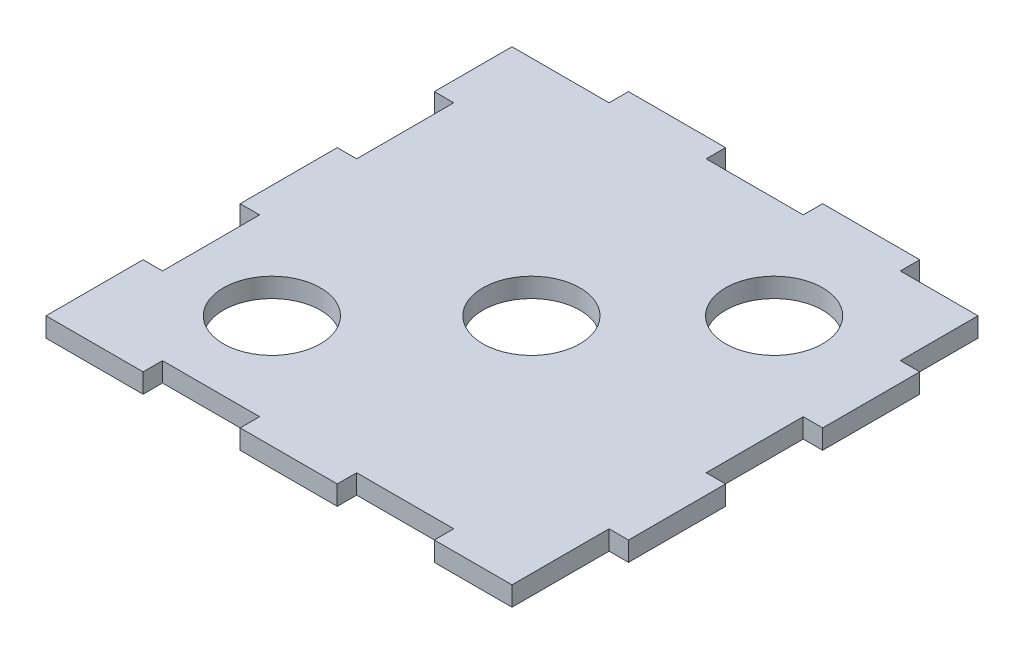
ISO-10303-21;
HEADER;
FILE_DESCRIPTION(('STEP AP214'),'2;1');
FILE_NAME('part.step','',(''),(''),'','','');
FILE_SCHEMA(('AUTOMOTIVE_DESIGN { 1 0 10303 214 1 1 1 1 }'));
ENDSEC;
DATA;
#1=APPLICATION_CONTEXT('core data for automotive mechanical design processes');
#2=APPLICATION_PROTOCOL_DEFINITION('international standard','automotive_design',2000,#1);
#3=PRODUCT_CONTEXT('',#1,'mechanical');
#4=PRODUCT('Part','Part','',(#3));
#5=PRODUCT_RELATED_PRODUCT_CATEGORY('part','',(#4));
#6=PRODUCT_DEFINITION_FORMATION('','',#4);
#7=PRODUCT_DEFINITION_CONTEXT('part definition',#1,'design');
#8=PRODUCT_DEFINITION('design','',#6,#7);
#9=PRODUCT_DEFINITION_SHAPE('','',#8);
#10=(LENGTH_UNIT() NAMED_UNIT(*) SI_UNIT(.MILLI.,.METRE.));
#11=(NAMED_UNIT(*) PLANE_ANGLE_UNIT() SI_UNIT($,.RADIAN.));
#12=(NAMED_UNIT(*) SI_UNIT($,.STERADIAN.) SOLID_ANGLE_UNIT());
#13=UNCERTAINTY_MEASURE_WITH_UNIT(LENGTH_MEASURE(1.E-05),#10,'distance_accuracy_value','');
#14=(GEOMETRIC_REPRESENTATION_CONTEXT(3) GLOBAL_UNCERTAINTY_ASSIGNED_CONTEXT((#13)) GLOBAL_UNIT_ASSIGNED_CONTEXT((#10,
#11,#12)) REPRESENTATION_CONTEXT('',''));
#15=CARTESIAN_POINT('',(0.,0.,0.));
#16=DIRECTION('',(0.,0.,1.));
#17=DIRECTION('',(1.,0.,0.));
#18=AXIS2_PLACEMENT_3D('',#15,#16,#17);
#19=CARTESIAN_POINT('',(0.,4.,0.));
#20=DIRECTION('',(0.,1.,0.));
#21=DIRECTION('',(0.,0.,1.));
#22=AXIS2_PLACEMENT_3D('',#19,#20,#21);
#23=PLANE('',#22);
#24=CARTESIAN_POINT('',(25.,4.,-25.));
#25=DIRECTION('',(0.,1.,0.));
#26=DIRECTION('',(0.,0.,1.));
#27=AXIS2_PLACEMENT_3D('',#24,#25,#26);
#28=CIRCLE('',#27,10.);
#29=CARTESIAN_POINT('',(25.,4.,-15.));
#30=VERTEX_POINT('',#29);
#31=EDGE_CURVE('E598',#30,#30,#28,.T.);
#32=ORIENTED_EDGE('',*,*,#31,.F.);
#33=EDGE_LOOP('',(#32));
#34=FACE_BOUND('',#33,.T.);
#35=DIRECTION('',(0.,0.,-1.));
#36=VECTOR('',#35,1.);
#37=CARTESIAN_POINT('',(46.,4.,30.));
#38=LINE('',#37,#36);
#39=CARTESIAN_POINT('',(46.,4.,50.));
#40=VERTEX_POINT('',#39);
#41=CARTESIAN_POINT('',(46.,4.,30.));
#42=VERTEX_POINT('',#41);
#43=EDGE_CURVE('E369',#40,#42,#38,.T.);
#44=ORIENTED_EDGE('',*,*,#43,.T.);
#45=DIRECTION('',(1.,0.,0.));
#46=VECTOR('',#45,1.);
#47=CARTESIAN_POINT('',(50.,4.,30.));
#48=LINE('',#47,#46);
#49=CARTESIAN_POINT('',(50.,4.,30.));
#50=VERTEX_POINT('',#49);
#51=EDGE_CURVE('E177',#42,#50,#48,.T.);
#52=ORIENTED_EDGE('',*,*,#51,.T.);
#53=DIRECTION('',(0.,0.,-1.));
#54=VECTOR('',#53,1.);
#55=CARTESIAN_POINT('',(50.,4.,9.99999999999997));
#56=LINE('',#55,#54);
#57=CARTESIAN_POINT('',(50.,4.,9.99999999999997));
#58=VERTEX_POINT('',#57);
#59=EDGE_CURVE('E468',#50,#58,#56,.T.);
#60=ORIENTED_EDGE('',*,*,#59,.T.);
#61=DIRECTION('',(-1.,0.,0.));
#62=VECTOR('',#61,1.);
#63=CARTESIAN_POINT('',(46.,4.,9.99999999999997));
#64=LINE('',#63,#62);
#65=CARTESIAN_POINT('',(46.,4.,9.99999999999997));
#66=VERTEX_POINT('',#65);
#67=EDGE_CURVE('E487',#58,#66,#64,.T.);
#68=ORIENTED_EDGE('',*,*,#67,.T.);
#69=DIRECTION('',(0.,0.,-1.));
#70=VECTOR('',#69,1.);
#71=CARTESIAN_POINT('',(46.,4.,-10.));
#72=LINE('',#71,#70);
#73=CARTESIAN_POINT('',(46.,4.,-10.));
#74=VERTEX_POINT('',#73);
#75=EDGE_CURVE('E484',#66,#74,#72,.T.);
#76=ORIENTED_EDGE('',*,*,#75,.T.);
#77=DIRECTION('',(1.,0.,0.));
#78=VECTOR('',#77,1.);
#79=CARTESIAN_POINT('',(50.,4.,-10.));
#80=LINE('',#79,#78);
#81=CARTESIAN_POINT('',(50.,4.,-10.));
#82=VERTEX_POINT('',#81);
#83=EDGE_CURVE('E486',#74,#82,#80,.T.);
#84=ORIENTED_EDGE('',*,*,#83,.T.);
#85=DIRECTION('',(0.,0.,-1.));
#86=VECTOR('',#85,1.);
#87=CARTESIAN_POINT('',(50.,4.,-30.));
#88=LINE('',#87,#86);
#89=CARTESIAN_POINT('',(50.,4.,-30.));
#90=VERTEX_POINT('',#89);
#91=EDGE_CURVE('E489',#82,#90,#88,.T.);
#92=ORIENTED_EDGE('',*,*,#91,.T.);
#93=DIRECTION('',(-1.,0.,0.));
#94=VECTOR('',#93,1.);
#95=CARTESIAN_POINT('',(46.,4.,-30.));
#96=LINE('',#95,#94);
#97=CARTESIAN_POINT('',(46.,4.,-30.));
#98=VERTEX_POINT('',#97);
#99=EDGE_CURVE('E495',#90,#98,#96,.T.);
#100=ORIENTED_EDGE('',*,*,#99,.T.);
#101=DIRECTION('',(0.,0.,-1.));
#102=VECTOR('',#101,1.);
#103=CARTESIAN_POINT('',(46.,4.,-46.));
#104=LINE('',#103,#102);
#105=CARTESIAN_POINT('',(46.,4.,-46.));
#106=VERTEX_POINT('',#105);
#107=EDGE_CURVE('E497',#98,#106,#104,.T.);
#108=ORIENTED_EDGE('',*,*,#107,.T.);
#109=DIRECTION('',(-1.,0.,0.));
#110=VECTOR('',#109,1.);
#111=CARTESIAN_POINT('',(30.,4.,-46.));
#112=LINE('',#111,#110);
#113=CARTESIAN_POINT('',(30.,4.,-46.));
#114=VERTEX_POINT('',#113);
#115=EDGE_CURVE('E499',#106,#114,#112,.T.);
#116=ORIENTED_EDGE('',*,*,#115,.T.);
#117=DIRECTION('',(0.,0.,-1.));
#118=VECTOR('',#117,1.);
#119=CARTESIAN_POINT('',(30.,4.,-50.));
#120=LINE('',#119,#118);
#121=CARTESIAN_POINT('',(30.,4.,-50.));
#122=VERTEX_POINT('',#121);
#123=EDGE_CURVE('E501',#114,#122,#120,.T.);
#124=ORIENTED_EDGE('',*,*,#123,.T.);
#125=DIRECTION('',(-1.,0.,0.));
#126=VECTOR('',#125,1.);
#127=CARTESIAN_POINT('',(9.99999999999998,4.,-50.));
#128=LINE('',#127,#126);
#129=CARTESIAN_POINT('',(9.99999999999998,4.,-50.));
#130=VERTEX_POINT('',#129);
#131=EDGE_CURVE('E503',#122,#130,#128,.T.);
#132=ORIENTED_EDGE('',*,*,#131,.T.);
#133=DIRECTION('',(0.,0.,1.));
#134=VECTOR('',#133,1.);
#135=CARTESIAN_POINT('',(9.99999999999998,4.,-46.));
#136=LINE('',#135,#134);
#137=CARTESIAN_POINT('',(9.99999999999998,4.,-46.));
#138=VERTEX_POINT('',#137);
#139=EDGE_CURVE('E505',#130,#138,#136,.T.);
#140=ORIENTED_EDGE('',*,*,#139,.T.);
#141=DIRECTION('',(-1.,0.,0.));
#142=VECTOR('',#141,1.);
#143=CARTESIAN_POINT('',(-10.,4.,-46.));
#144=LINE('',#143,#142);
#145=CARTESIAN_POINT('',(-10.,4.,-46.));
#146=VERTEX_POINT('',#145);
#147=EDGE_CURVE('E507',#138,#146,#144,.T.);
#148=ORIENTED_EDGE('',*,*,#147,.T.);
#149=DIRECTION('',(0.,0.,-1.));
#150=VECTOR('',#149,1.);
#151=CARTESIAN_POINT('',(-10.,4.,-50.));
#152=LINE('',#151,#150);
#153=CARTESIAN_POINT('',(-10.,4.,-50.));
#154=VERTEX_POINT('',#153);
#155=EDGE_CURVE('E509',#146,#154,#152,.T.);
#156=ORIENTED_EDGE('',*,*,#155,.T.);
#157=DIRECTION('',(-1.,0.,0.));
#158=VECTOR('',#157,1.);
#159=CARTESIAN_POINT('',(-30.,4.,-50.));
#160=LINE('',#159,#158);
#161=CARTESIAN_POINT('',(-30.,4.,-50.));
#162=VERTEX_POINT('',#161);
#163=EDGE_CURVE('E511',#154,#162,#160,.T.);
#164=ORIENTED_EDGE('',*,*,#163,.T.);
#165=DIRECTION('',(0.,0.,1.));
#166=VECTOR('',#165,1.);
#167=CARTESIAN_POINT('',(-30.,4.,-46.));
#168=LINE('',#167,#166);
#169=CARTESIAN_POINT('',(-30.,4.,-46.));
#170=VERTEX_POINT('',#169);
#171=EDGE_CURVE('E513',#162,#170,#168,.T.);
#172=ORIENTED_EDGE('',*,*,#171,.T.);
#173=DIRECTION('',(-1.,0.,0.));
#174=VECTOR('',#173,1.);
#175=CARTESIAN_POINT('',(-50.,4.,-46.));
#176=LINE('',#175,#174);
#177=CARTESIAN_POINT('',(-50.,4.,-46.));
#178=VERTEX_POINT('',#177);
#179=EDGE_CURVE('E515',#170,#178,#176,.T.);
#180=ORIENTED_EDGE('',*,*,#179,.T.);
#181=DIRECTION('',(0.,0.,1.));
#182=VECTOR('',#181,1.);
#183=CARTESIAN_POINT('',(-50.,4.,-46.));
#184=LINE('',#183,#182);
#185=CARTESIAN_POINT('',(-50.,4.,-30.));
#186=VERTEX_POINT('',#185);
#187=EDGE_CURVE('E517',#178,#186,#184,.T.);
#188=ORIENTED_EDGE('',*,*,#187,.T.);
#189=DIRECTION('',(1.,0.,0.));
#190=VECTOR('',#189,1.);
#191=CARTESIAN_POINT('',(-50.,4.,-30.));
#192=LINE('',#191,#190);
#193=CARTESIAN_POINT('',(-46.,4.,-30.));
#194=VERTEX_POINT('',#193);
#195=EDGE_CURVE('E519',#186,#194,#192,.T.);
#196=ORIENTED_EDGE('',*,*,#195,.T.);
#197=DIRECTION('',(0.,0.,1.));
#198=VECTOR('',#197,1.);
#199=CARTESIAN_POINT('',(-46.,4.,-30.));
#200=LINE('',#199,#198);
#201=CARTESIAN_POINT('',(-46.,4.,-10.));
#202=VERTEX_POINT('',#201);
#203=EDGE_CURVE('E521',#194,#202,#200,.T.);
#204=ORIENTED_EDGE('',*,*,#203,.T.);
#205=DIRECTION('',(-1.,0.,0.));
#206=VECTOR('',#205,1.);
#207=CARTESIAN_POINT('',(-46.,4.,-10.));
#208=LINE('',#207,#206);
#209=CARTESIAN_POINT('',(-50.,4.,-10.));
#210=VERTEX_POINT('',#209);
#211=EDGE_CURVE('E523',#202,#210,#208,.T.);
#212=ORIENTED_EDGE('',*,*,#211,.T.);
#213=DIRECTION('',(0.,0.,1.));
#214=VECTOR('',#213,1.);
#215=CARTESIAN_POINT('',(-50.,4.,-10.));
#216=LINE('',#215,#214);
#217=CARTESIAN_POINT('',(-50.,4.,9.99999999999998));
#218=VERTEX_POINT('',#217);
#219=EDGE_CURVE('E525',#210,#218,#216,.T.);
#220=ORIENTED_EDGE('',*,*,#219,.T.);
#221=DIRECTION('',(1.,0.,0.));
#222=VECTOR('',#221,1.);
#223=CARTESIAN_POINT('',(-50.,4.,9.99999999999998));
#224=LINE('',#223,#222);
#225=CARTESIAN_POINT('',(-46.,4.,9.99999999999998));
#226=VERTEX_POINT('',#225);
#227=EDGE_CURVE('E527',#218,#226,#224,.T.);
#228=ORIENTED_EDGE('',*,*,#227,.T.);
#229=DIRECTION('',(0.,0.,1.));
#230=VECTOR('',#229,1.);
#231=CARTESIAN_POINT('',(-46.,4.,9.99999999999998));
#232=LINE('',#231,#230);
#233=CARTESIAN_POINT('',(-46.,4.,30.));
#234=VERTEX_POINT('',#233);
#235=EDGE_CURVE('E529',#226,#234,#232,.T.);
#236=ORIENTED_EDGE('',*,*,#235,.T.);
#237=DIRECTION('',(-1.,0.,0.));
#238=VECTOR('',#237,1.);
#239=CARTESIAN_POINT('',(-46.,4.,30.));
#240=LINE('',#239,#238);
#241=CARTESIAN_POINT('',(-50.,4.,30.));
#242=VERTEX_POINT('',#241);
#243=EDGE_CURVE('E531',#234,#242,#240,.T.);
#244=ORIENTED_EDGE('',*,*,#243,.T.);
#245=DIRECTION('',(0.,0.,1.));
#246=VECTOR('',#245,1.);
#247=CARTESIAN_POINT('',(-50.,4.,30.));
#248=LINE('',#247,#246);
#249=CARTESIAN_POINT('',(-50.,4.,50.));
#250=VERTEX_POINT('',#249);
#251=EDGE_CURVE('E533',#242,#250,#248,.T.);
#252=ORIENTED_EDGE('',*,*,#251,.T.);
#253=DIRECTION('',(1.,0.,0.));
#254=VECTOR('',#253,1.);
#255=CARTESIAN_POINT('',(-50.,4.,50.));
#256=LINE('',#255,#254);
#257=CARTESIAN_POINT('',(-30.,4.,50.));
#258=VERTEX_POINT('',#257);
#259=EDGE_CURVE('E535',#250,#258,#256,.T.);
#260=ORIENTED_EDGE('',*,*,#259,.T.);
#261=DIRECTION('',(0.,0.,-1.));
#262=VECTOR('',#261,1.);
#263=CARTESIAN_POINT('',(-30.,4.,46.));
#264=LINE('',#263,#262);
#265=CARTESIAN_POINT('',(-30.,4.,46.));
#266=VERTEX_POINT('',#265);
#267=EDGE_CURVE('E537',#258,#266,#264,.T.);
#268=ORIENTED_EDGE('',*,*,#267,.T.);
#269=DIRECTION('',(1.,0.,0.));
#270=VECTOR('',#269,1.);
#271=CARTESIAN_POINT('',(-10.,4.,46.));
#272=LINE('',#271,#270);
#273=CARTESIAN_POINT('',(-10.,4.,46.));
#274=VERTEX_POINT('',#273);
#275=EDGE_CURVE('E539',#266,#274,#272,.T.);
#276=ORIENTED_EDGE('',*,*,#275,.T.);
#277=DIRECTION('',(0.,0.,1.));
#278=VECTOR('',#277,1.);
#279=CARTESIAN_POINT('',(-10.,4.,50.));
#280=LINE('',#279,#278);
#281=CARTESIAN_POINT('',(-10.,4.,50.));
#282=VERTEX_POINT('',#281);
#283=EDGE_CURVE('E541',#274,#282,#280,.T.);
#284=ORIENTED_EDGE('',*,*,#283,.T.);
#285=DIRECTION('',(1.,0.,0.));
#286=VECTOR('',#285,1.);
#287=CARTESIAN_POINT('',(-10.,4.,50.));
#288=LINE('',#287,#286);
#289=CARTESIAN_POINT('',(9.99999999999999,4.,50.));
#290=VERTEX_POINT('',#289);
#291=EDGE_CURVE('E543',#282,#290,#288,.T.);
#292=ORIENTED_EDGE('',*,*,#291,.T.);
#293=DIRECTION('',(0.,0.,-1.));
#294=VECTOR('',#293,1.);
#295=CARTESIAN_POINT('',(9.99999999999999,4.,50.));
#296=LINE('',#295,#294);
#297=CARTESIAN_POINT('',(9.99999999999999,4.,46.));
#298=VERTEX_POINT('',#297);
#299=EDGE_CURVE('E280',#290,#298,#296,.T.);
#300=ORIENTED_EDGE('',*,*,#299,.T.);
#301=DIRECTION('',(1.,0.,0.));
#302=VECTOR('',#301,1.);
#303=CARTESIAN_POINT('',(9.99999999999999,4.,46.));
#304=LINE('',#303,#302);
#305=CARTESIAN_POINT('',(30.,4.,46.));
#306=VERTEX_POINT('',#305);
#307=EDGE_CURVE('E274',#298,#306,#304,.T.);
#308=ORIENTED_EDGE('',*,*,#307,.T.);
#309=DIRECTION('',(0.,0.,1.));
#310=VECTOR('',#309,1.);
#311=CARTESIAN_POINT('',(30.,4.,46.));
#312=LINE('',#311,#310);
#313=CARTESIAN_POINT('',(30.,4.,50.));
#314=VERTEX_POINT('',#313);
#315=EDGE_CURVE('E278',#306,#314,#312,.T.);
#316=ORIENTED_EDGE('',*,*,#315,.T.);
#317=DIRECTION('',(1.,0.,0.));
#318=VECTOR('',#317,1.);
#319=CARTESIAN_POINT('',(30.,4.,50.));
#320=LINE('',#319,#318);
#321=EDGE_CURVE('E50',#314,#40,#320,.T.);
#322=ORIENTED_EDGE('',*,*,#321,.T.);
#323=EDGE_LOOP('',(#44,#52,#60,#68,#76,#84,#92,#100,#108,#116,#124,#132,#140,#148,#156,#164,
#172,#180,#188,#196,#204,#212,#220,#228,#236,#244,#252,#260,#268,#276,#284,#292,#300,#308,#316,#322));
#324=FACE_BOUND('',#323,.T.);
#325=CARTESIAN_POINT('',(0.,4.,0.));
#326=DIRECTION('',(0.,1.,0.));
#327=DIRECTION('',(0.,0.,1.));
#328=AXIS2_PLACEMENT_3D('',#325,#326,#327);
#329=CIRCLE('',#328,10.);
#330=CARTESIAN_POINT('',(0.,4.,10.));
#331=VERTEX_POINT('',#330);
#332=EDGE_CURVE('E302',#331,#331,#329,.T.);
#333=ORIENTED_EDGE('',*,*,#332,.F.);
#334=EDGE_LOOP('',(#333));
#335=FACE_BOUND('',#334,.T.);
#336=CARTESIAN_POINT('',(-26.7320869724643,4.,26.7320869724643));
#337=DIRECTION('',(0.,1.,0.));
#338=DIRECTION('',(0.,0.,1.));
#339=AXIS2_PLACEMENT_3D('',#336,#337,#338);
#340=CIRCLE('',#339,10.);
#341=CARTESIAN_POINT('',(-26.7320869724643,4.,36.7320869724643));
#342=VERTEX_POINT('',#341);
#343=EDGE_CURVE('E589',#342,#342,#340,.T.);
#344=ORIENTED_EDGE('',*,*,#343,.F.);
#345=EDGE_LOOP('',(#344));
#346=FACE_BOUND('',#345,.T.);
#347=ADVANCED_FACE('F33',(#34,#324,#335,#346),#23,.T.);
#348=CARTESIAN_POINT('',(0.,0.,0.));
#349=DIRECTION('',(0.,1.,0.));
#350=DIRECTION('',(0.,0.,1.));
#351=AXIS2_PLACEMENT_3D('',#348,#349,#350);
#352=PLANE('',#351);
#353=DIRECTION('',(0.,0.,-1.));
#354=VECTOR('',#353,1.);
#355=CARTESIAN_POINT('',(46.,0.,30.));
#356=LINE('',#355,#354);
#357=CARTESIAN_POINT('',(46.,0.,50.));
#358=VERTEX_POINT('',#357);
#359=CARTESIAN_POINT('',(46.,0.,30.));
#360=VERTEX_POINT('',#359);
#361=EDGE_CURVE('E298',#358,#360,#356,.T.);
#362=ORIENTED_EDGE('',*,*,#361,.F.);
#363=DIRECTION('',(1.,0.,0.));
#364=VECTOR('',#363,1.);
#365=CARTESIAN_POINT('',(30.,0.,50.));
#366=LINE('',#365,#364);
#367=CARTESIAN_POINT('',(30.,0.,50.));
#368=VERTEX_POINT('',#367);
#369=EDGE_CURVE('E169',#368,#358,#366,.T.);
#370=ORIENTED_EDGE('',*,*,#369,.F.);
#371=DIRECTION('',(0.,0.,1.));
#372=VECTOR('',#371,1.);
#373=CARTESIAN_POINT('',(30.,0.,46.));
#374=LINE('',#373,#372);
#375=CARTESIAN_POINT('',(30.,0.,46.));
#376=VERTEX_POINT('',#375);
#377=EDGE_CURVE('E163',#376,#368,#374,.T.);
#378=ORIENTED_EDGE('',*,*,#377,.F.);
#379=DIRECTION('',(1.,0.,0.));
#380=VECTOR('',#379,1.);
#381=CARTESIAN_POINT('',(9.99999999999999,0.,46.));
#382=LINE('',#381,#380);
#383=CARTESIAN_POINT('',(9.99999999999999,0.,46.));
#384=VERTEX_POINT('',#383);
#385=EDGE_CURVE('E288',#384,#376,#382,.T.);
#386=ORIENTED_EDGE('',*,*,#385,.F.);
#387=DIRECTION('',(0.,0.,-1.));
#388=VECTOR('',#387,1.);
#389=CARTESIAN_POINT('',(9.99999999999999,0.,50.));
#390=LINE('',#389,#388);
#391=CARTESIAN_POINT('',(9.99999999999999,0.,50.));
#392=VERTEX_POINT('',#391);
#393=EDGE_CURVE('E364',#392,#384,#390,.T.);
#394=ORIENTED_EDGE('',*,*,#393,.F.);
#395=DIRECTION('',(1.,0.,0.));
#396=VECTOR('',#395,1.);
#397=CARTESIAN_POINT('',(-10.,0.,50.));
#398=LINE('',#397,#396);
#399=CARTESIAN_POINT('',(-10.,0.,50.));
#400=VERTEX_POINT('',#399);
#401=EDGE_CURVE('E362',#400,#392,#398,.T.);
#402=ORIENTED_EDGE('',*,*,#401,.F.);
#403=DIRECTION('',(0.,0.,1.));
#404=VECTOR('',#403,1.);
#405=CARTESIAN_POINT('',(-10.,0.,50.));
#406=LINE('',#405,#404);
#407=CARTESIAN_POINT('',(-10.,0.,46.));
#408=VERTEX_POINT('',#407);
#409=EDGE_CURVE('E360',#408,#400,#406,.T.);
#410=ORIENTED_EDGE('',*,*,#409,.F.);
#411=DIRECTION('',(1.,0.,0.));
#412=VECTOR('',#411,1.);
#413=CARTESIAN_POINT('',(-10.,0.,46.));
#414=LINE('',#413,#412);
#415=CARTESIAN_POINT('',(-30.,0.,46.));
#416=VERTEX_POINT('',#415);
#417=EDGE_CURVE('E358',#416,#408,#414,.T.);
#418=ORIENTED_EDGE('',*,*,#417,.F.);
#419=DIRECTION('',(0.,0.,-1.));
#420=VECTOR('',#419,1.);
#421=CARTESIAN_POINT('',(-30.,0.,46.));
#422=LINE('',#421,#420);
#423=CARTESIAN_POINT('',(-30.,0.,50.));
#424=VERTEX_POINT('',#423);
#425=EDGE_CURVE('E356',#424,#416,#422,.T.);
#426=ORIENTED_EDGE('',*,*,#425,.F.);
#427=DIRECTION('',(1.,0.,0.));
#428=VECTOR('',#427,1.);
#429=CARTESIAN_POINT('',(-50.,0.,50.));
#430=LINE('',#429,#428);
#431=CARTESIAN_POINT('',(-50.,0.,50.));
#432=VERTEX_POINT('',#431);
#433=EDGE_CURVE('E354',#432,#424,#430,.T.);
#434=ORIENTED_EDGE('',*,*,#433,.F.);
#435=DIRECTION('',(0.,0.,1.));
#436=VECTOR('',#435,1.);
#437=CARTESIAN_POINT('',(-50.,0.,30.));
#438=LINE('',#437,#436);
#439=CARTESIAN_POINT('',(-50.,0.,30.));
#440=VERTEX_POINT('',#439);
#441=EDGE_CURVE('E352',#440,#432,#438,.T.);
#442=ORIENTED_EDGE('',*,*,#441,.F.);
#443=DIRECTION('',(-1.,0.,0.));
#444=VECTOR('',#443,1.);
#445=CARTESIAN_POINT('',(-46.,0.,30.));
#446=LINE('',#445,#444);
#447=CARTESIAN_POINT('',(-46.,0.,30.));
#448=VERTEX_POINT('',#447);
#449=EDGE_CURVE('E350',#448,#440,#446,.T.);
#450=ORIENTED_EDGE('',*,*,#449,.F.);
#451=DIRECTION('',(0.,0.,1.));
#452=VECTOR('',#451,1.);
#453=CARTESIAN_POINT('',(-46.,0.,9.99999999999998));
#454=LINE('',#453,#452);
#455=CARTESIAN_POINT('',(-46.,0.,9.99999999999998));
#456=VERTEX_POINT('',#455);
#457=EDGE_CURVE('E348',#456,#448,#454,.T.);
#458=ORIENTED_EDGE('',*,*,#457,.F.);
#459=DIRECTION('',(1.,0.,0.));
#460=VECTOR('',#459,1.);
#461=CARTESIAN_POINT('',(-50.,0.,9.99999999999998));
#462=LINE('',#461,#460);
#463=CARTESIAN_POINT('',(-50.,0.,9.99999999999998));
#464=VERTEX_POINT('',#463);
#465=EDGE_CURVE('E346',#464,#456,#462,.T.);
#466=ORIENTED_EDGE('',*,*,#465,.F.);
#467=DIRECTION('',(0.,0.,1.));
#468=VECTOR('',#467,1.);
#469=CARTESIAN_POINT('',(-50.,0.,-10.));
#470=LINE('',#469,#468);
#471=CARTESIAN_POINT('',(-50.,0.,-10.));
#472=VERTEX_POINT('',#471);
#473=EDGE_CURVE('E344',#472,#464,#470,.T.);
#474=ORIENTED_EDGE('',*,*,#473,.F.);
#475=DIRECTION('',(-1.,0.,0.));
#476=VECTOR('',#475,1.);
#477=CARTESIAN_POINT('',(-46.,0.,-10.));
#478=LINE('',#477,#476);
#479=CARTESIAN_POINT('',(-46.,0.,-10.));
#480=VERTEX_POINT('',#479);
#481=EDGE_CURVE('E342',#480,#472,#478,.T.);
#482=ORIENTED_EDGE('',*,*,#481,.F.);
#483=DIRECTION('',(0.,0.,1.));
#484=VECTOR('',#483,1.);
#485=CARTESIAN_POINT('',(-46.,0.,-30.));
#486=LINE('',#485,#484);
#487=CARTESIAN_POINT('',(-46.,0.,-30.));
#488=VERTEX_POINT('',#487);
#489=EDGE_CURVE('E340',#488,#480,#486,.T.);
#490=ORIENTED_EDGE('',*,*,#489,.F.);
#491=DIRECTION('',(1.,0.,0.));
#492=VECTOR('',#491,1.);
#493=CARTESIAN_POINT('',(-50.,0.,-30.));
#494=LINE('',#493,#492);
#495=CARTESIAN_POINT('',(-50.,0.,-30.));
#496=VERTEX_POINT('',#495);
#497=EDGE_CURVE('E338',#496,#488,#494,.T.);
#498=ORIENTED_EDGE('',*,*,#497,.F.);
#499=DIRECTION('',(0.,0.,1.));
#500=VECTOR('',#499,1.);
#501=CARTESIAN_POINT('',(-50.,0.,-46.));
#502=LINE('',#501,#500);
#503=CARTESIAN_POINT('',(-50.,0.,-46.));
#504=VERTEX_POINT('',#503);
#505=EDGE_CURVE('E336',#504,#496,#502,.T.);
#506=ORIENTED_EDGE('',*,*,#505,.F.);
#507=DIRECTION('',(-1.,0.,0.));
#508=VECTOR('',#507,1.);
#509=CARTESIAN_POINT('',(-50.,0.,-46.));
#510=LINE('',#509,#508);
#511=CARTESIAN_POINT('',(-30.,0.,-46.));
#512=VERTEX_POINT('',#511);
#513=EDGE_CURVE('E334',#512,#504,#510,.T.);
#514=ORIENTED_EDGE('',*,*,#513,.F.);
#515=DIRECTION('',(0.,0.,1.));
#516=VECTOR('',#515,1.);
#517=CARTESIAN_POINT('',(-30.,0.,-46.));
#518=LINE('',#517,#516);
#519=CARTESIAN_POINT('',(-30.,0.,-50.));
#520=VERTEX_POINT('',#519);
#521=EDGE_CURVE('E332',#520,#512,#518,.T.);
#522=ORIENTED_EDGE('',*,*,#521,.F.);
#523=DIRECTION('',(-1.,0.,0.));
#524=VECTOR('',#523,1.);
#525=CARTESIAN_POINT('',(-30.,0.,-50.));
#526=LINE('',#525,#524);
#527=CARTESIAN_POINT('',(-10.,0.,-50.));
#528=VERTEX_POINT('',#527);
#529=EDGE_CURVE('E330',#528,#520,#526,.T.);
#530=ORIENTED_EDGE('',*,*,#529,.F.);
#531=DIRECTION('',(0.,0.,-1.));
#532=VECTOR('',#531,1.);
#533=CARTESIAN_POINT('',(-10.,0.,-50.));
#534=LINE('',#533,#532);
#535=CARTESIAN_POINT('',(-10.,0.,-46.));
#536=VERTEX_POINT('',#535);
#537=EDGE_CURVE('E328',#536,#528,#534,.T.);
#538=ORIENTED_EDGE('',*,*,#537,.F.);
#539=DIRECTION('',(-1.,0.,0.));
#540=VECTOR('',#539,1.);
#541=CARTESIAN_POINT('',(-10.,0.,-46.));
#542=LINE('',#541,#540);
#543=CARTESIAN_POINT('',(9.99999999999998,0.,-46.));
#544=VERTEX_POINT('',#543);
#545=EDGE_CURVE('E326',#544,#536,#542,.T.);
#546=ORIENTED_EDGE('',*,*,#545,.F.);
#547=DIRECTION('',(0.,0.,1.));
#548=VECTOR('',#547,1.);
#549=CARTESIAN_POINT('',(9.99999999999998,0.,-46.));
#550=LINE('',#549,#548);
#551=CARTESIAN_POINT('',(9.99999999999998,0.,-50.));
#552=VERTEX_POINT('',#551);
#553=EDGE_CURVE('E324',#552,#544,#550,.T.);
#554=ORIENTED_EDGE('',*,*,#553,.F.);
#555=DIRECTION('',(-1.,0.,0.));
#556=VECTOR('',#555,1.);
#557=CARTESIAN_POINT('',(9.99999999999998,0.,-50.));
#558=LINE('',#557,#556);
#559=CARTESIAN_POINT('',(30.,0.,-50.));
#560=VERTEX_POINT('',#559);
#561=EDGE_CURVE('E322',#560,#552,#558,.T.);
#562=ORIENTED_EDGE('',*,*,#561,.F.);
#563=DIRECTION('',(0.,0.,-1.));
#564=VECTOR('',#563,1.);
#565=CARTESIAN_POINT('',(30.,0.,-50.));
#566=LINE('',#565,#564);
#567=CARTESIAN_POINT('',(30.,0.,-46.));
#568=VERTEX_POINT('',#567);
#569=EDGE_CURVE('E320',#568,#560,#566,.T.);
#570=ORIENTED_EDGE('',*,*,#569,.F.);
#571=DIRECTION('',(-1.,0.,0.));
#572=VECTOR('',#571,1.);
#573=CARTESIAN_POINT('',(30.,0.,-46.));
#574=LINE('',#573,#572);
#575=CARTESIAN_POINT('',(46.,0.,-46.));
#576=VERTEX_POINT('',#575);
#577=EDGE_CURVE('E318',#576,#568,#574,.T.);
#578=ORIENTED_EDGE('',*,*,#577,.F.);
#579=DIRECTION('',(0.,0.,-1.));
#580=VECTOR('',#579,1.);
#581=CARTESIAN_POINT('',(46.,0.,-46.));
#582=LINE('',#581,#580);
#583=CARTESIAN_POINT('',(46.,0.,-30.));
#584=VERTEX_POINT('',#583);
#585=EDGE_CURVE('E316',#584,#576,#582,.T.);
#586=ORIENTED_EDGE('',*,*,#585,.F.);
#587=DIRECTION('',(-1.,0.,0.));
#588=VECTOR('',#587,1.);
#589=CARTESIAN_POINT('',(46.,0.,-30.));
#590=LINE('',#589,#588);
#591=CARTESIAN_POINT('',(50.,0.,-30.));
#592=VERTEX_POINT('',#591);
#593=EDGE_CURVE('E314',#592,#584,#590,.T.);
#594=ORIENTED_EDGE('',*,*,#593,.F.);
#595=DIRECTION('',(0.,0.,-1.));
#596=VECTOR('',#595,1.);
#597=CARTESIAN_POINT('',(50.,0.,-30.));
#598=LINE('',#597,#596);
#599=CARTESIAN_POINT('',(50.,0.,-10.));
#600=VERTEX_POINT('',#599);
#601=EDGE_CURVE('E312',#600,#592,#598,.T.);
#602=ORIENTED_EDGE('',*,*,#601,.F.);
#603=DIRECTION('',(1.,0.,0.));
#604=VECTOR('',#603,1.);
#605=CARTESIAN_POINT('',(50.,0.,-10.));
#606=LINE('',#605,#604);
#607=CARTESIAN_POINT('',(46.,0.,-10.));
#608=VERTEX_POINT('',#607);
#609=EDGE_CURVE('E310',#608,#600,#606,.T.);
#610=ORIENTED_EDGE('',*,*,#609,.F.);
#611=DIRECTION('',(0.,0.,-1.));
#612=VECTOR('',#611,1.);
#613=CARTESIAN_POINT('',(46.,0.,-10.));
#614=LINE('',#613,#612);
#615=CARTESIAN_POINT('',(46.,0.,9.99999999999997));
#616=VERTEX_POINT('',#615);
#617=EDGE_CURVE('E308',#616,#608,#614,.T.);
#618=ORIENTED_EDGE('',*,*,#617,.F.);
#619=DIRECTION('',(-1.,0.,0.));
#620=VECTOR('',#619,1.);
#621=CARTESIAN_POINT('',(46.,0.,9.99999999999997));
#622=LINE('',#621,#620);
#623=CARTESIAN_POINT('',(50.,0.,9.99999999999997));
#624=VERTEX_POINT('',#623);
#625=EDGE_CURVE('E306',#624,#616,#622,.T.);
#626=ORIENTED_EDGE('',*,*,#625,.F.);
#627=DIRECTION('',(0.,0.,-1.));
#628=VECTOR('',#627,1.);
#629=CARTESIAN_POINT('',(50.,0.,9.99999999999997));
#630=LINE('',#629,#628);
#631=CARTESIAN_POINT('',(50.,0.,30.));
#632=VERTEX_POINT('',#631);
#633=EDGE_CURVE('E304',#632,#624,#630,.T.);
#634=ORIENTED_EDGE('',*,*,#633,.F.);
#635=DIRECTION('',(1.,0.,0.));
#636=VECTOR('',#635,1.);
#637=CARTESIAN_POINT('',(50.,0.,30.));
#638=LINE('',#637,#636);
#639=EDGE_CURVE('E301',#360,#632,#638,.T.);
#640=ORIENTED_EDGE('',*,*,#639,.F.);
#641=EDGE_LOOP('',(#362,#370,#378,#386,#394,#402,#410,#418,#426,#434,#442,#450,#458,#466,#474,
#482,#490,#498,#506,#514,#522,#530,#538,#546,#554,#562,#570,#578,#586,#594,#602,#610,#618,#626,
#634,#640));
#642=FACE_BOUND('',#641,.T.);
#643=CARTESIAN_POINT('',(0.,0.,0.));
#644=DIRECTION('',(0.,1.,0.));
#645=DIRECTION('',(0.,0.,1.));
#646=AXIS2_PLACEMENT_3D('',#643,#644,#645);
#647=CIRCLE('',#646,10.);
#648=CARTESIAN_POINT('',(0.,0.,10.));
#649=VERTEX_POINT('',#648);
#650=EDGE_CURVE('E601',#649,#649,#647,.T.);
#651=ORIENTED_EDGE('',*,*,#650,.T.);
#652=EDGE_LOOP('',(#651));
#653=FACE_BOUND('',#652,.T.);
#654=CARTESIAN_POINT('',(25.,0.,-25.));
#655=DIRECTION('',(0.,1.,0.));
#656=DIRECTION('',(0.,0.,1.));
#657=AXIS2_PLACEMENT_3D('',#654,#655,#656);
#658=CIRCLE('',#657,10.);
#659=CARTESIAN_POINT('',(25.,0.,-15.));
#660=VERTEX_POINT('',#659);
#661=EDGE_CURVE('E595',#660,#660,#658,.T.);
#662=ORIENTED_EDGE('',*,*,#661,.T.);
#663=EDGE_LOOP('',(#662));
#664=FACE_BOUND('',#663,.T.);
#665=CARTESIAN_POINT('',(-26.7320869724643,0.,26.7320869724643));
#666=DIRECTION('',(0.,1.,0.));
#667=DIRECTION('',(0.,0.,1.));
#668=AXIS2_PLACEMENT_3D('',#665,#666,#667);
#669=CIRCLE('',#668,10.);
#670=CARTESIAN_POINT('',(-26.7320869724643,0.,36.7320869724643));
#671=VERTEX_POINT('',#670);
#672=EDGE_CURVE('E592',#671,#671,#669,.T.);
#673=ORIENTED_EDGE('',*,*,#672,.T.);
#674=EDGE_LOOP('',(#673));
#675=FACE_BOUND('',#674,.T.);
#676=ADVANCED_FACE('F472',(#642,#653,#664,#675),#352,.F.);
#677=CARTESIAN_POINT('',(46.,4.,30.));
#678=DIRECTION('',(-1.,0.,0.));
#679=DIRECTION('',(0.,0.,1.));
#680=AXIS2_PLACEMENT_3D('',#677,#678,#679);
#681=PLANE('',#680);
#682=ORIENTED_EDGE('',*,*,#361,.T.);
#683=DIRECTION('',(0.,-1.,0.));
#684=VECTOR('',#683,1.);
#685=CARTESIAN_POINT('',(46.,4.,30.));
#686=LINE('',#685,#684);
#687=EDGE_CURVE('E11',#42,#360,#686,.T.);
#688=ORIENTED_EDGE('',*,*,#687,.F.);
#689=ORIENTED_EDGE('',*,*,#43,.F.);
#690=DIRECTION('',(0.,-1.,0.));
#691=VECTOR('',#690,1.);
#692=CARTESIAN_POINT('',(46.,4.,50.));
#693=LINE('',#692,#691);
#694=EDGE_CURVE('E294',#40,#358,#693,.T.);
#695=ORIENTED_EDGE('',*,*,#694,.T.);
#696=EDGE_LOOP('',(#682,#688,#689,#695));
#697=FACE_BOUND('',#696,.T.);
#698=ADVANCED_FACE('F35',(#697),#681,.F.);
#699=CARTESIAN_POINT('',(50.,4.,30.));
#700=DIRECTION('',(0.,0.,-1.));
#701=DIRECTION('',(-1.,0.,0.));
#702=AXIS2_PLACEMENT_3D('',#699,#700,#701);
#703=PLANE('',#702);
#704=ORIENTED_EDGE('',*,*,#639,.T.);
#705=DIRECTION('',(0.,-1.,0.));
#706=VECTOR('',#705,1.);
#707=CARTESIAN_POINT('',(50.,4.,30.));
#708=LINE('',#707,#706);
#709=EDGE_CURVE('E42',#50,#632,#708,.T.);
#710=ORIENTED_EDGE('',*,*,#709,.F.);
#711=ORIENTED_EDGE('',*,*,#51,.F.);
#712=ORIENTED_EDGE('',*,*,#687,.T.);
#713=EDGE_LOOP('',(#704,#710,#711,#712));
#714=FACE_BOUND('',#713,.T.);
#715=ADVANCED_FACE('F943',(#714),#703,.F.);
#716=CARTESIAN_POINT('',(50.,4.,9.99999999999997));
#717=DIRECTION('',(-1.,0.,0.));
#718=DIRECTION('',(0.,0.,1.));
#719=AXIS2_PLACEMENT_3D('',#716,#717,#718);
#720=PLANE('',#719);
#721=ORIENTED_EDGE('',*,*,#633,.T.);
#722=DIRECTION('',(0.,-1.,0.));
#723=VECTOR('',#722,1.);
#724=CARTESIAN_POINT('',(50.,4.,9.99999999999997));
#725=LINE('',#724,#723);
#726=EDGE_CURVE('E460',#58,#624,#725,.T.);
#727=ORIENTED_EDGE('',*,*,#726,.F.);
#728=ORIENTED_EDGE('',*,*,#59,.F.);
#729=ORIENTED_EDGE('',*,*,#709,.T.);
#730=EDGE_LOOP('',(#721,#727,#728,#729));
#731=FACE_BOUND('',#730,.T.);
#732=ADVANCED_FACE('F466',(#731),#720,.F.);
#733=CARTESIAN_POINT('',(46.,4.,9.99999999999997));
#734=DIRECTION('',(0.,0.,1.));
#735=DIRECTION('',(1.,0.,0.));
#736=AXIS2_PLACEMENT_3D('',#733,#734,#735);
#737=PLANE('',#736);
#738=ORIENTED_EDGE('',*,*,#625,.T.);
#739=DIRECTION('',(0.,-1.,0.));
#740=VECTOR('',#739,1.);
#741=CARTESIAN_POINT('',(46.,4.,9.99999999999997));
#742=LINE('',#741,#740);
#743=EDGE_CURVE('E457',#66,#616,#742,.T.);
#744=ORIENTED_EDGE('',*,*,#743,.F.);
#745=ORIENTED_EDGE('',*,*,#67,.F.);
#746=ORIENTED_EDGE('',*,*,#726,.T.);
#747=EDGE_LOOP('',(#738,#744,#745,#746));
#748=FACE_BOUND('',#747,.T.);
#749=ADVANCED_FACE('F478',(#748),#737,.F.);
#750=CARTESIAN_POINT('',(46.,4.,-10.));
#751=DIRECTION('',(-1.,0.,0.));
#752=DIRECTION('',(0.,0.,1.));
#753=AXIS2_PLACEMENT_3D('',#750,#751,#752);
#754=PLANE('',#753);
#755=ORIENTED_EDGE('',*,*,#617,.T.);
#756=DIRECTION('',(0.,-1.,0.));
#757=VECTOR('',#756,1.);
#758=CARTESIAN_POINT('',(46.,4.,-10.));
#759=LINE('',#758,#757);
#760=EDGE_CURVE('E454',#74,#608,#759,.T.);
#761=ORIENTED_EDGE('',*,*,#760,.F.);
#762=ORIENTED_EDGE('',*,*,#75,.F.);
#763=ORIENTED_EDGE('',*,*,#743,.T.);
#764=EDGE_LOOP('',(#755,#761,#762,#763));
#765=FACE_BOUND('',#764,.T.);
#766=ADVANCED_FACE('F482',(#765),#754,.F.);
#767=CARTESIAN_POINT('',(50.,4.,-10.));
#768=DIRECTION('',(0.,0.,-1.));
#769=DIRECTION('',(-1.,0.,0.));
#770=AXIS2_PLACEMENT_3D('',#767,#768,#769);
#771=PLANE('',#770);
#772=ORIENTED_EDGE('',*,*,#609,.T.);
#773=DIRECTION('',(0.,-1.,0.));
#774=VECTOR('',#773,1.);
#775=CARTESIAN_POINT('',(50.,4.,-10.));
#776=LINE('',#775,#774);
#777=EDGE_CURVE('E451',#82,#600,#776,.T.);
#778=ORIENTED_EDGE('',*,*,#777,.F.);
#779=ORIENTED_EDGE('',*,*,#83,.F.);
#780=ORIENTED_EDGE('',*,*,#760,.T.);
#781=EDGE_LOOP('',(#772,#778,#779,#780));
#782=FACE_BOUND('',#781,.T.);
#783=ADVANCED_FACE('F908',(#782),#771,.F.);
#784=CARTESIAN_POINT('',(50.,4.,-30.));
#785=DIRECTION('',(-1.,0.,0.));
#786=DIRECTION('',(0.,0.,1.));
#787=AXIS2_PLACEMENT_3D('',#784,#785,#786);
#788=PLANE('',#787);
#789=ORIENTED_EDGE('',*,*,#601,.T.);
#790=DIRECTION('',(0.,-1.,0.));
#791=VECTOR('',#790,1.);
#792=CARTESIAN_POINT('',(50.,4.,-30.));
#793=LINE('',#792,#791);
#794=EDGE_CURVE('E448',#90,#592,#793,.T.);
#795=ORIENTED_EDGE('',*,*,#794,.F.);
#796=ORIENTED_EDGE('',*,*,#91,.F.);
#797=ORIENTED_EDGE('',*,*,#777,.T.);
#798=EDGE_LOOP('',(#789,#795,#796,#797));
#799=FACE_BOUND('',#798,.T.);
#800=ADVANCED_FACE('F898',(#799),#788,.F.);
#801=CARTESIAN_POINT('',(46.,4.,-30.));
#802=DIRECTION('',(0.,0.,1.));
#803=DIRECTION('',(1.,0.,0.));
#804=AXIS2_PLACEMENT_3D('',#801,#802,#803);
#805=PLANE('',#804);
#806=ORIENTED_EDGE('',*,*,#593,.T.);
#807=DIRECTION('',(0.,-1.,0.));
#808=VECTOR('',#807,1.);
#809=CARTESIAN_POINT('',(46.,4.,-30.));
#810=LINE('',#809,#808);
#811=EDGE_CURVE('E445',#98,#584,#810,.T.);
#812=ORIENTED_EDGE('',*,*,#811,.F.);
#813=ORIENTED_EDGE('',*,*,#99,.F.);
#814=ORIENTED_EDGE('',*,*,#794,.T.);
#815=EDGE_LOOP('',(#806,#812,#813,#814));
#816=FACE_BOUND('',#815,.T.);
#817=ADVANCED_FACE('F888',(#816),#805,.F.);
#818=CARTESIAN_POINT('',(46.,4.,-46.));
#819=DIRECTION('',(-1.,0.,0.));
#820=DIRECTION('',(0.,0.,1.));
#821=AXIS2_PLACEMENT_3D('',#818,#819,#820);
#822=PLANE('',#821);
#823=ORIENTED_EDGE('',*,*,#585,.T.);
#824=DIRECTION('',(0.,-1.,0.));
#825=VECTOR('',#824,1.);
#826=CARTESIAN_POINT('',(46.,4.,-46.));
#827=LINE('',#826,#825);
#828=EDGE_CURVE('E442',#106,#576,#827,.T.);
#829=ORIENTED_EDGE('',*,*,#828,.F.);
#830=ORIENTED_EDGE('',*,*,#107,.F.);
#831=ORIENTED_EDGE('',*,*,#811,.T.);
#832=EDGE_LOOP('',(#823,#829,#830,#831));
#833=FACE_BOUND('',#832,.T.);
#834=ADVANCED_FACE('F878',(#833),#822,.F.);
#835=CARTESIAN_POINT('',(30.,4.,-46.));
#836=DIRECTION('',(0.,0.,1.));
#837=DIRECTION('',(1.,0.,0.));
#838=AXIS2_PLACEMENT_3D('',#835,#836,#837);
#839=PLANE('',#838);
#840=ORIENTED_EDGE('',*,*,#577,.T.);
#841=DIRECTION('',(0.,-1.,0.));
#842=VECTOR('',#841,1.);
#843=CARTESIAN_POINT('',(30.,4.,-46.));
#844=LINE('',#843,#842);
#845=EDGE_CURVE('E439',#114,#568,#844,.T.);
#846=ORIENTED_EDGE('',*,*,#845,.F.);
#847=ORIENTED_EDGE('',*,*,#115,.F.);
#848=ORIENTED_EDGE('',*,*,#828,.T.);
#849=EDGE_LOOP('',(#840,#846,#847,#848));
#850=FACE_BOUND('',#849,.T.);
#851=ADVANCED_FACE('F868',(#850),#839,.F.);
#852=CARTESIAN_POINT('',(30.,4.,-50.));
#853=DIRECTION('',(-1.,0.,0.));
#854=DIRECTION('',(0.,0.,1.));
#855=AXIS2_PLACEMENT_3D('',#852,#853,#854);
#856=PLANE('',#855);
#857=ORIENTED_EDGE('',*,*,#569,.T.);
#858=DIRECTION('',(0.,-1.,0.));
#859=VECTOR('',#858,1.);
#860=CARTESIAN_POINT('',(30.,4.,-50.));
#861=LINE('',#860,#859);
#862=EDGE_CURVE('E436',#122,#560,#861,.T.);
#863=ORIENTED_EDGE('',*,*,#862,.F.);
#864=ORIENTED_EDGE('',*,*,#123,.F.);
#865=ORIENTED_EDGE('',*,*,#845,.T.);
#866=EDGE_LOOP('',(#857,#863,#864,#865));
#867=FACE_BOUND('',#866,.T.);
#868=ADVANCED_FACE('F858',(#867),#856,.F.);
#869=CARTESIAN_POINT('',(9.99999999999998,4.,-50.));
#870=DIRECTION('',(0.,0.,1.));
#871=DIRECTION('',(1.,0.,0.));
#872=AXIS2_PLACEMENT_3D('',#869,#870,#871);
#873=PLANE('',#872);
#874=ORIENTED_EDGE('',*,*,#561,.T.);
#875=DIRECTION('',(0.,-1.,0.));
#876=VECTOR('',#875,1.);
#877=CARTESIAN_POINT('',(9.99999999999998,4.,-50.));
#878=LINE('',#877,#876);
#879=EDGE_CURVE('E433',#130,#552,#878,.T.);
#880=ORIENTED_EDGE('',*,*,#879,.F.);
#881=ORIENTED_EDGE('',*,*,#131,.F.);
#882=ORIENTED_EDGE('',*,*,#862,.T.);
#883=EDGE_LOOP('',(#874,#880,#881,#882));
#884=FACE_BOUND('',#883,.T.);
#885=ADVANCED_FACE('F848',(#884),#873,.F.);
#886=CARTESIAN_POINT('',(9.99999999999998,4.,-46.));
#887=DIRECTION('',(1.,0.,0.));
#888=DIRECTION('',(0.,0.,-1.));
#889=AXIS2_PLACEMENT_3D('',#886,#887,#888);
#890=PLANE('',#889);
#891=ORIENTED_EDGE('',*,*,#553,.T.);
#892=DIRECTION('',(0.,-1.,0.));
#893=VECTOR('',#892,1.);
#894=CARTESIAN_POINT('',(9.99999999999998,4.,-46.));
#895=LINE('',#894,#893);
#896=EDGE_CURVE('E430',#138,#544,#895,.T.);
#897=ORIENTED_EDGE('',*,*,#896,.F.);
#898=ORIENTED_EDGE('',*,*,#139,.F.);
#899=ORIENTED_EDGE('',*,*,#879,.T.);
#900=EDGE_LOOP('',(#891,#897,#898,#899));
#901=FACE_BOUND('',#900,.T.);
#902=ADVANCED_FACE('F838',(#901),#890,.F.);
#903=CARTESIAN_POINT('',(-10.,4.,-46.));
#904=DIRECTION('',(0.,0.,1.));
#905=DIRECTION('',(1.,0.,0.));
#906=AXIS2_PLACEMENT_3D('',#903,#904,#905);
#907=PLANE('',#906);
#908=ORIENTED_EDGE('',*,*,#545,.T.);
#909=DIRECTION('',(0.,-1.,0.));
#910=VECTOR('',#909,1.);
#911=CARTESIAN_POINT('',(-10.,4.,-46.));
#912=LINE('',#911,#910);
#913=EDGE_CURVE('E427',#146,#536,#912,.T.);
#914=ORIENTED_EDGE('',*,*,#913,.F.);
#915=ORIENTED_EDGE('',*,*,#147,.F.);
#916=ORIENTED_EDGE('',*,*,#896,.T.);
#917=EDGE_LOOP('',(#908,#914,#915,#916));
#918=FACE_BOUND('',#917,.T.);
#919=ADVANCED_FACE('F828',(#918),#907,.F.);
#920=CARTESIAN_POINT('',(-10.,4.,-50.));
#921=DIRECTION('',(-1.,0.,0.));
#922=DIRECTION('',(0.,0.,1.));
#923=AXIS2_PLACEMENT_3D('',#920,#921,#922);
#924=PLANE('',#923);
#925=ORIENTED_EDGE('',*,*,#537,.T.);
#926=DIRECTION('',(0.,-1.,0.));
#927=VECTOR('',#926,1.);
#928=CARTESIAN_POINT('',(-10.,4.,-50.));
#929=LINE('',#928,#927);
#930=EDGE_CURVE('E424',#154,#528,#929,.T.);
#931=ORIENTED_EDGE('',*,*,#930,.F.);
#932=ORIENTED_EDGE('',*,*,#155,.F.);
#933=ORIENTED_EDGE('',*,*,#913,.T.);
#934=EDGE_LOOP('',(#925,#931,#932,#933));
#935=FACE_BOUND('',#934,.T.);
#936=ADVANCED_FACE('F818',(#935),#924,.F.);
#937=CARTESIAN_POINT('',(-30.,4.,-50.));
#938=DIRECTION('',(0.,0.,1.));
#939=DIRECTION('',(1.,0.,0.));
#940=AXIS2_PLACEMENT_3D('',#937,#938,#939);
#941=PLANE('',#940);
#942=ORIENTED_EDGE('',*,*,#529,.T.);
#943=DIRECTION('',(0.,-1.,0.));
#944=VECTOR('',#943,1.);
#945=CARTESIAN_POINT('',(-30.,4.,-50.));
#946=LINE('',#945,#944);
#947=EDGE_CURVE('E421',#162,#520,#946,.T.);
#948=ORIENTED_EDGE('',*,*,#947,.F.);
#949=ORIENTED_EDGE('',*,*,#163,.F.);
#950=ORIENTED_EDGE('',*,*,#930,.T.);
#951=EDGE_LOOP('',(#942,#948,#949,#950));
#952=FACE_BOUND('',#951,.T.);
#953=ADVANCED_FACE('F808',(#952),#941,.F.);
#954=CARTESIAN_POINT('',(-30.,4.,-46.));
#955=DIRECTION('',(1.,0.,0.));
#956=DIRECTION('',(0.,0.,-1.));
#957=AXIS2_PLACEMENT_3D('',#954,#955,#956);
#958=PLANE('',#957);
#959=ORIENTED_EDGE('',*,*,#521,.T.);
#960=DIRECTION('',(0.,-1.,0.));
#961=VECTOR('',#960,1.);
#962=CARTESIAN_POINT('',(-30.,4.,-46.));
#963=LINE('',#962,#961);
#964=EDGE_CURVE('E418',#170,#512,#963,.T.);
#965=ORIENTED_EDGE('',*,*,#964,.F.);
#966=ORIENTED_EDGE('',*,*,#171,.F.);
#967=ORIENTED_EDGE('',*,*,#947,.T.);
#968=EDGE_LOOP('',(#959,#965,#966,#967));
#969=FACE_BOUND('',#968,.T.);
#970=ADVANCED_FACE('F798',(#969),#958,.F.);
#971=CARTESIAN_POINT('',(-50.,4.,-46.));
#972=DIRECTION('',(0.,0.,1.));
#973=DIRECTION('',(1.,0.,0.));
#974=AXIS2_PLACEMENT_3D('',#971,#972,#973);
#975=PLANE('',#974);
#976=ORIENTED_EDGE('',*,*,#513,.T.);
#977=DIRECTION('',(0.,-1.,0.));
#978=VECTOR('',#977,1.);
#979=CARTESIAN_POINT('',(-50.,4.,-46.));
#980=LINE('',#979,#978);
#981=EDGE_CURVE('E415',#178,#504,#980,.T.);
#982=ORIENTED_EDGE('',*,*,#981,.F.);
#983=ORIENTED_EDGE('',*,*,#179,.F.);
#984=ORIENTED_EDGE('',*,*,#964,.T.);
#985=EDGE_LOOP('',(#976,#982,#983,#984));
#986=FACE_BOUND('',#985,.T.);
#987=ADVANCED_FACE('F788',(#986),#975,.F.);
#988=CARTESIAN_POINT('',(-50.,4.,-46.));
#989=DIRECTION('',(1.,0.,0.));
#990=DIRECTION('',(0.,0.,-1.));
#991=AXIS2_PLACEMENT_3D('',#988,#989,#990);
#992=PLANE('',#991);
#993=ORIENTED_EDGE('',*,*,#505,.T.);
#994=DIRECTION('',(0.,-1.,0.));
#995=VECTOR('',#994,1.);
#996=CARTESIAN_POINT('',(-50.,4.,-30.));
#997=LINE('',#996,#995);
#998=EDGE_CURVE('E412',#186,#496,#997,.T.);
#999=ORIENTED_EDGE('',*,*,#998,.F.);
#1000=ORIENTED_EDGE('',*,*,#187,.F.);
#1001=ORIENTED_EDGE('',*,*,#981,.T.);
#1002=EDGE_LOOP('',(#993,#999,#1000,#1001));
#1003=FACE_BOUND('',#1002,.T.);
#1004=ADVANCED_FACE('F778',(#1003),#992,.F.);
#1005=CARTESIAN_POINT('',(-50.,4.,-30.));
#1006=DIRECTION('',(0.,0.,-1.));
#1007=DIRECTION('',(-1.,0.,0.));
#1008=AXIS2_PLACEMENT_3D('',#1005,#1006,#1007);
#1009=PLANE('',#1008);
#1010=ORIENTED_EDGE('',*,*,#497,.T.);
#1011=DIRECTION('',(0.,-1.,0.));
#1012=VECTOR('',#1011,1.);
#1013=CARTESIAN_POINT('',(-46.,4.,-30.));
#1014=LINE('',#1013,#1012);
#1015=EDGE_CURVE('E409',#194,#488,#1014,.T.);
#1016=ORIENTED_EDGE('',*,*,#1015,.F.);
#1017=ORIENTED_EDGE('',*,*,#195,.F.);
#1018=ORIENTED_EDGE('',*,*,#998,.T.);
#1019=EDGE_LOOP('',(#1010,#1016,#1017,#1018));
#1020=FACE_BOUND('',#1019,.T.);
#1021=ADVANCED_FACE('F768',(#1020),#1009,.F.);
#1022=CARTESIAN_POINT('',(-46.,4.,-30.));
#1023=DIRECTION('',(1.,0.,0.));
#1024=DIRECTION('',(0.,0.,-1.));
#1025=AXIS2_PLACEMENT_3D('',#1022,#1023,#1024);
#1026=PLANE('',#1025);
#1027=ORIENTED_EDGE('',*,*,#489,.T.);
#1028=DIRECTION('',(0.,-1.,0.));
#1029=VECTOR('',#1028,1.);
#1030=CARTESIAN_POINT('',(-46.,4.,-10.));
#1031=LINE('',#1030,#1029);
#1032=EDGE_CURVE('E406',#202,#480,#1031,.T.);
#1033=ORIENTED_EDGE('',*,*,#1032,.F.);
#1034=ORIENTED_EDGE('',*,*,#203,.F.);
#1035=ORIENTED_EDGE('',*,*,#1015,.T.);
#1036=EDGE_LOOP('',(#1027,#1033,#1034,#1035));
#1037=FACE_BOUND('',#1036,.T.);
#1038=ADVANCED_FACE('F758',(#1037),#1026,.F.);
#1039=CARTESIAN_POINT('',(-46.,4.,-10.));
#1040=DIRECTION('',(0.,0.,1.));
#1041=DIRECTION('',(1.,0.,0.));
#1042=AXIS2_PLACEMENT_3D('',#1039,#1040,#1041);
#1043=PLANE('',#1042);
#1044=ORIENTED_EDGE('',*,*,#481,.T.);
#1045=DIRECTION('',(0.,-1.,0.));
#1046=VECTOR('',#1045,1.);
#1047=CARTESIAN_POINT('',(-50.,4.,-10.));
#1048=LINE('',#1047,#1046);
#1049=EDGE_CURVE('E403',#210,#472,#1048,.T.);
#1050=ORIENTED_EDGE('',*,*,#1049,.F.);
#1051=ORIENTED_EDGE('',*,*,#211,.F.);
#1052=ORIENTED_EDGE('',*,*,#1032,.T.);
#1053=EDGE_LOOP('',(#1044,#1050,#1051,#1052));
#1054=FACE_BOUND('',#1053,.T.);
#1055=ADVANCED_FACE('F748',(#1054),#1043,.F.);
#1056=CARTESIAN_POINT('',(-50.,4.,-10.));
#1057=DIRECTION('',(1.,0.,0.));
#1058=DIRECTION('',(0.,0.,-1.));
#1059=AXIS2_PLACEMENT_3D('',#1056,#1057,#1058);
#1060=PLANE('',#1059);
#1061=ORIENTED_EDGE('',*,*,#473,.T.);
#1062=DIRECTION('',(0.,-1.,0.));
#1063=VECTOR('',#1062,1.);
#1064=CARTESIAN_POINT('',(-50.,4.,9.99999999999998));
#1065=LINE('',#1064,#1063);
#1066=EDGE_CURVE('E400',#218,#464,#1065,.T.);
#1067=ORIENTED_EDGE('',*,*,#1066,.F.);
#1068=ORIENTED_EDGE('',*,*,#219,.F.);
#1069=ORIENTED_EDGE('',*,*,#1049,.T.);
#1070=EDGE_LOOP('',(#1061,#1067,#1068,#1069));
#1071=FACE_BOUND('',#1070,.T.);
#1072=ADVANCED_FACE('F738',(#1071),#1060,.F.);
#1073=CARTESIAN_POINT('',(-50.,4.,9.99999999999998));
#1074=DIRECTION('',(0.,0.,-1.));
#1075=DIRECTION('',(-1.,0.,0.));
#1076=AXIS2_PLACEMENT_3D('',#1073,#1074,#1075);
#1077=PLANE('',#1076);
#1078=ORIENTED_EDGE('',*,*,#465,.T.);
#1079=DIRECTION('',(0.,-1.,0.));
#1080=VECTOR('',#1079,1.);
#1081=CARTESIAN_POINT('',(-46.,4.,9.99999999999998));
#1082=LINE('',#1081,#1080);
#1083=EDGE_CURVE('E397',#226,#456,#1082,.T.);
#1084=ORIENTED_EDGE('',*,*,#1083,.F.);
#1085=ORIENTED_EDGE('',*,*,#227,.F.);
#1086=ORIENTED_EDGE('',*,*,#1066,.T.);
#1087=EDGE_LOOP('',(#1078,#1084,#1085,#1086));
#1088=FACE_BOUND('',#1087,.T.);
#1089=ADVANCED_FACE('F728',(#1088),#1077,.F.);
#1090=CARTESIAN_POINT('',(-46.,4.,9.99999999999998));
#1091=DIRECTION('',(1.,0.,0.));
#1092=DIRECTION('',(0.,0.,-1.));
#1093=AXIS2_PLACEMENT_3D('',#1090,#1091,#1092);
#1094=PLANE('',#1093);
#1095=ORIENTED_EDGE('',*,*,#457,.T.);
#1096=DIRECTION('',(0.,-1.,0.));
#1097=VECTOR('',#1096,1.);
#1098=CARTESIAN_POINT('',(-46.,4.,30.));
#1099=LINE('',#1098,#1097);
#1100=EDGE_CURVE('E394',#234,#448,#1099,.T.);
#1101=ORIENTED_EDGE('',*,*,#1100,.F.);
#1102=ORIENTED_EDGE('',*,*,#235,.F.);
#1103=ORIENTED_EDGE('',*,*,#1083,.T.);
#1104=EDGE_LOOP('',(#1095,#1101,#1102,#1103));
#1105=FACE_BOUND('',#1104,.T.);
#1106=ADVANCED_FACE('F718',(#1105),#1094,.F.);
#1107=CARTESIAN_POINT('',(-46.,4.,30.));
#1108=DIRECTION('',(0.,0.,1.));
#1109=DIRECTION('',(1.,0.,0.));
#1110=AXIS2_PLACEMENT_3D('',#1107,#1108,#1109);
#1111=PLANE('',#1110);
#1112=ORIENTED_EDGE('',*,*,#449,.T.);
#1113=DIRECTION('',(0.,-1.,0.));
#1114=VECTOR('',#1113,1.);
#1115=CARTESIAN_POINT('',(-50.,4.,30.));
#1116=LINE('',#1115,#1114);
#1117=EDGE_CURVE('E391',#242,#440,#1116,.T.);
#1118=ORIENTED_EDGE('',*,*,#1117,.F.);
#1119=ORIENTED_EDGE('',*,*,#243,.F.);
#1120=ORIENTED_EDGE('',*,*,#1100,.T.);
#1121=EDGE_LOOP('',(#1112,#1118,#1119,#1120));
#1122=FACE_BOUND('',#1121,.T.);
#1123=ADVANCED_FACE('F708',(#1122),#1111,.F.);
#1124=CARTESIAN_POINT('',(-50.,4.,30.));
#1125=DIRECTION('',(1.,0.,0.));
#1126=DIRECTION('',(0.,0.,-1.));
#1127=AXIS2_PLACEMENT_3D('',#1124,#1125,#1126);
#1128=PLANE('',#1127);
#1129=ORIENTED_EDGE('',*,*,#441,.T.);
#1130=DIRECTION('',(0.,-1.,0.));
#1131=VECTOR('',#1130,1.);
#1132=CARTESIAN_POINT('',(-50.,4.,50.));
#1133=LINE('',#1132,#1131);
#1134=EDGE_CURVE('E388',#250,#432,#1133,.T.);
#1135=ORIENTED_EDGE('',*,*,#1134,.F.);
#1136=ORIENTED_EDGE('',*,*,#251,.F.);
#1137=ORIENTED_EDGE('',*,*,#1117,.T.);
#1138=EDGE_LOOP('',(#1129,#1135,#1136,#1137));
#1139=FACE_BOUND('',#1138,.T.);
#1140=ADVANCED_FACE('F698',(#1139),#1128,.F.);
#1141=CARTESIAN_POINT('',(-50.,4.,50.));
#1142=DIRECTION('',(0.,0.,-1.));
#1143=DIRECTION('',(-1.,0.,0.));
#1144=AXIS2_PLACEMENT_3D('',#1141,#1142,#1143);
#1145=PLANE('',#1144);
#1146=ORIENTED_EDGE('',*,*,#433,.T.);
#1147=DIRECTION('',(0.,-1.,0.));
#1148=VECTOR('',#1147,1.);
#1149=CARTESIAN_POINT('',(-30.,4.,50.));
#1150=LINE('',#1149,#1148);
#1151=EDGE_CURVE('E385',#258,#424,#1150,.T.);
#1152=ORIENTED_EDGE('',*,*,#1151,.F.);
#1153=ORIENTED_EDGE('',*,*,#259,.F.);
#1154=ORIENTED_EDGE('',*,*,#1134,.T.);
#1155=EDGE_LOOP('',(#1146,#1152,#1153,#1154));
#1156=FACE_BOUND('',#1155,.T.);
#1157=ADVANCED_FACE('F688',(#1156),#1145,.F.);
#1158=CARTESIAN_POINT('',(-30.,4.,46.));
#1159=DIRECTION('',(-1.,0.,0.));
#1160=DIRECTION('',(0.,0.,1.));
#1161=AXIS2_PLACEMENT_3D('',#1158,#1159,#1160);
#1162=PLANE('',#1161);
#1163=ORIENTED_EDGE('',*,*,#425,.T.);
#1164=DIRECTION('',(0.,-1.,0.));
#1165=VECTOR('',#1164,1.);
#1166=CARTESIAN_POINT('',(-30.,4.,46.));
#1167=LINE('',#1166,#1165);
#1168=EDGE_CURVE('E382',#266,#416,#1167,.T.);
#1169=ORIENTED_EDGE('',*,*,#1168,.F.);
#1170=ORIENTED_EDGE('',*,*,#267,.F.);
#1171=ORIENTED_EDGE('',*,*,#1151,.T.);
#1172=EDGE_LOOP('',(#1163,#1169,#1170,#1171));
#1173=FACE_BOUND('',#1172,.T.);
#1174=ADVANCED_FACE('F678',(#1173),#1162,.F.);
#1175=CARTESIAN_POINT('',(-10.,4.,46.));
#1176=DIRECTION('',(0.,0.,-1.));
#1177=DIRECTION('',(-1.,0.,0.));
#1178=AXIS2_PLACEMENT_3D('',#1175,#1176,#1177);
#1179=PLANE('',#1178);
#1180=ORIENTED_EDGE('',*,*,#417,.T.);
#1181=DIRECTION('',(0.,-1.,0.));
#1182=VECTOR('',#1181,1.);
#1183=CARTESIAN_POINT('',(-10.,4.,46.));
#1184=LINE('',#1183,#1182);
#1185=EDGE_CURVE('E379',#274,#408,#1184,.T.);
#1186=ORIENTED_EDGE('',*,*,#1185,.F.);
#1187=ORIENTED_EDGE('',*,*,#275,.F.);
#1188=ORIENTED_EDGE('',*,*,#1168,.T.);
#1189=EDGE_LOOP('',(#1180,#1186,#1187,#1188));
#1190=FACE_BOUND('',#1189,.T.);
#1191=ADVANCED_FACE('F668',(#1190),#1179,.F.);
#1192=CARTESIAN_POINT('',(-10.,4.,50.));
#1193=DIRECTION('',(1.,0.,0.));
#1194=DIRECTION('',(0.,0.,-1.));
#1195=AXIS2_PLACEMENT_3D('',#1192,#1193,#1194);
#1196=PLANE('',#1195);
#1197=ORIENTED_EDGE('',*,*,#409,.T.);
#1198=DIRECTION('',(0.,-1.,0.));
#1199=VECTOR('',#1198,1.);
#1200=CARTESIAN_POINT('',(-10.,4.,50.));
#1201=LINE('',#1200,#1199);
#1202=EDGE_CURVE('E376',#282,#400,#1201,.T.);
#1203=ORIENTED_EDGE('',*,*,#1202,.F.);
#1204=ORIENTED_EDGE('',*,*,#283,.F.);
#1205=ORIENTED_EDGE('',*,*,#1185,.T.);
#1206=EDGE_LOOP('',(#1197,#1203,#1204,#1205));
#1207=FACE_BOUND('',#1206,.T.);
#1208=ADVANCED_FACE('F659',(#1207),#1196,.F.);
#1209=CARTESIAN_POINT('',(-10.,4.,50.));
#1210=DIRECTION('',(0.,0.,-1.));
#1211=DIRECTION('',(-1.,0.,0.));
#1212=AXIS2_PLACEMENT_3D('',#1209,#1210,#1211);
#1213=PLANE('',#1212);
#1214=ORIENTED_EDGE('',*,*,#401,.T.);
#1215=DIRECTION('',(0.,-1.,0.));
#1216=VECTOR('',#1215,1.);
#1217=CARTESIAN_POINT('',(9.99999999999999,4.,50.));
#1218=LINE('',#1217,#1216);
#1219=EDGE_CURVE('E373',#290,#392,#1218,.T.);
#1220=ORIENTED_EDGE('',*,*,#1219,.F.);
#1221=ORIENTED_EDGE('',*,*,#291,.F.);
#1222=ORIENTED_EDGE('',*,*,#1202,.T.);
#1223=EDGE_LOOP('',(#1214,#1220,#1221,#1222));
#1224=FACE_BOUND('',#1223,.T.);
#1225=ADVANCED_FACE('F549',(#1224),#1213,.F.);
#1226=CARTESIAN_POINT('',(9.99999999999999,4.,50.));
#1227=DIRECTION('',(-1.,0.,0.));
#1228=DIRECTION('',(0.,0.,1.));
#1229=AXIS2_PLACEMENT_3D('',#1226,#1227,#1228);
#1230=PLANE('',#1229);
#1231=ORIENTED_EDGE('',*,*,#393,.T.);
#1232=DIRECTION('',(0.,-1.,0.));
#1233=VECTOR('',#1232,1.);
#1234=CARTESIAN_POINT('',(9.99999999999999,4.,46.));
#1235=LINE('',#1234,#1233);
#1236=EDGE_CURVE('E289',#298,#384,#1235,.T.);
#1237=ORIENTED_EDGE('',*,*,#1236,.F.);
#1238=ORIENTED_EDGE('',*,*,#299,.F.);
#1239=ORIENTED_EDGE('',*,*,#1219,.T.);
#1240=EDGE_LOOP('',(#1231,#1237,#1238,#1239));
#1241=FACE_BOUND('',#1240,.T.);
#1242=ADVANCED_FACE('F553',(#1241),#1230,.F.);
#1243=CARTESIAN_POINT('',(9.99999999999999,4.,46.));
#1244=DIRECTION('',(0.,0.,-1.));
#1245=DIRECTION('',(-1.,0.,0.));
#1246=AXIS2_PLACEMENT_3D('',#1243,#1244,#1245);
#1247=PLANE('',#1246);
#1248=ORIENTED_EDGE('',*,*,#385,.T.);
#1249=DIRECTION('',(0.,-1.,0.));
#1250=VECTOR('',#1249,1.);
#1251=CARTESIAN_POINT('',(30.,4.,46.));
#1252=LINE('',#1251,#1250);
#1253=EDGE_CURVE('E285',#306,#376,#1252,.T.);
#1254=ORIENTED_EDGE('',*,*,#1253,.F.);
#1255=ORIENTED_EDGE('',*,*,#307,.F.);
#1256=ORIENTED_EDGE('',*,*,#1236,.T.);
#1257=EDGE_LOOP('',(#1248,#1254,#1255,#1256));
#1258=FACE_BOUND('',#1257,.T.);
#1259=ADVANCED_FACE('F286',(#1258),#1247,.F.);
#1260=CARTESIAN_POINT('',(30.,4.,46.));
#1261=DIRECTION('',(1.,0.,0.));
#1262=DIRECTION('',(0.,0.,-1.));
#1263=AXIS2_PLACEMENT_3D('',#1260,#1261,#1262);
#1264=PLANE('',#1263);
#1265=ORIENTED_EDGE('',*,*,#377,.T.);
#1266=DIRECTION('',(0.,-1.,0.));
#1267=VECTOR('',#1266,1.);
#1268=CARTESIAN_POINT('',(30.,4.,50.));
#1269=LINE('',#1268,#1267);
#1270=EDGE_CURVE('E290',#314,#368,#1269,.T.);
#1271=ORIENTED_EDGE('',*,*,#1270,.F.);
#1272=ORIENTED_EDGE('',*,*,#315,.F.);
#1273=ORIENTED_EDGE('',*,*,#1253,.T.);
#1274=EDGE_LOOP('',(#1265,#1271,#1272,#1273));
#1275=FACE_BOUND('',#1274,.T.);
#1276=ADVANCED_FACE('F292',(#1275),#1264,.F.);
#1277=CARTESIAN_POINT('',(30.,4.,50.));
#1278=DIRECTION('',(0.,0.,-1.));
#1279=DIRECTION('',(-1.,0.,0.));
#1280=AXIS2_PLACEMENT_3D('',#1277,#1278,#1279);
#1281=PLANE('',#1280);
#1282=ORIENTED_EDGE('',*,*,#369,.T.);
#1283=ORIENTED_EDGE('',*,*,#694,.F.);
#1284=ORIENTED_EDGE('',*,*,#321,.F.);
#1285=ORIENTED_EDGE('',*,*,#1270,.T.);
#1286=EDGE_LOOP('',(#1282,#1283,#1284,#1285));
#1287=FACE_BOUND('',#1286,.T.);
#1288=ADVANCED_FACE('F557',(#1287),#1281,.F.);
#1289=CARTESIAN_POINT('',(0.,4.,0.));
#1290=DIRECTION('',(0.,-1.,0.));
#1291=DIRECTION('',(0.,0.,-1.));
#1292=AXIS2_PLACEMENT_3D('',#1289,#1290,#1291);
#1293=CYLINDRICAL_SURFACE('',#1292,10.);
#1294=ORIENTED_EDGE('',*,*,#332,.T.);
#1295=EDGE_LOOP('',(#1294));
#1296=FACE_BOUND('',#1295,.T.);
#1297=ORIENTED_EDGE('',*,*,#650,.F.);
#1298=EDGE_LOOP('',(#1297));
#1299=FACE_BOUND('',#1298,.T.);
#1300=ADVANCED_FACE('F559',(#1296,#1299),#1293,.F.);
#1301=CARTESIAN_POINT('',(25.,4.,-25.));
#1302=DIRECTION('',(0.,-1.,0.));
#1303=DIRECTION('',(0.,0.,-1.));
#1304=AXIS2_PLACEMENT_3D('',#1301,#1302,#1303);
#1305=CYLINDRICAL_SURFACE('',#1304,10.);
#1306=ORIENTED_EDGE('',*,*,#31,.T.);
#1307=EDGE_LOOP('',(#1306));
#1308=FACE_BOUND('',#1307,.T.);
#1309=ORIENTED_EDGE('',*,*,#661,.F.);
#1310=EDGE_LOOP('',(#1309));
#1311=FACE_BOUND('',#1310,.T.);
#1312=ADVANCED_FACE('F565',(#1308,#1311),#1305,.F.);
#1313=CARTESIAN_POINT('',(-26.7320869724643,4.,26.7320869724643));
#1314=DIRECTION('',(0.,-1.,0.));
#1315=DIRECTION('',(0.,0.,-1.));
#1316=AXIS2_PLACEMENT_3D('',#1313,#1314,#1315);
#1317=CYLINDRICAL_SURFACE('',#1316,10.);
#1318=ORIENTED_EDGE('',*,*,#343,.T.);
#1319=EDGE_LOOP('',(#1318));
#1320=FACE_BOUND('',#1319,.T.);
#1321=ORIENTED_EDGE('',*,*,#672,.F.);
#1322=EDGE_LOOP('',(#1321));
#1323=FACE_BOUND('',#1322,.T.);
#1324=ADVANCED_FACE('F580',(#1320,#1323),#1317,.F.);
#1325=CLOSED_SHELL('',(#347,#676,#698,#715,#732,#749,#766,#783,#800,#817,#834,#851,#868,#885,
#902,#919,#936,#953,#970,#987,#1004,#1021,#1038,#1055,#1072,#1089,#1106,#1123,#1140,#1157,#1174,
#1191,#1208,#1225,#1242,#1259,#1276,#1288,#1300,#1312,#1324));
#1326=MANIFOLD_SOLID_BREP('B2',#1325);
#1327=ADVANCED_BREP_SHAPE_REPRESENTATION('',(#18,#1326),#14);
#1328=SHAPE_DEFINITION_REPRESENTATION(#9,#1327);
ENDSEC;
END-ISO-10303-21;
